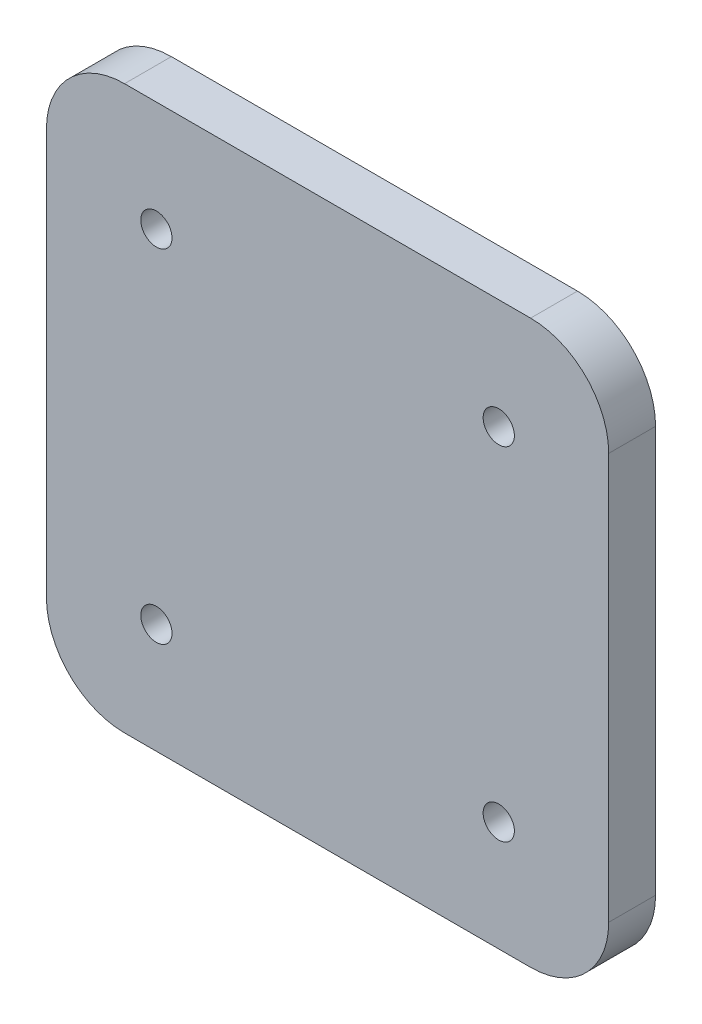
from build123d import *

# Parameters (mm, degrees)
SKETCH_1_R      = 1
EXTRUDE_1_DEPTH = 3


with BuildPart() as part:
    # Sketch 1 → Extrude 1 (new body)
    with BuildSketch(Plane.XY):
        with BuildLine():
            Line((-13, 18), (13, 18))
            ThreePointArc((13, 18), (16.535533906, 16.535533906), (18, 13))
            Line((18, 13), (18, -13))
            ThreePointArc((18, -13), (16.535533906, -16.535533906), (13, -18))
            Line((13, -18), (-13, -18))
            ThreePointArc((-13, -18), (-16.535533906, -16.535533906), (-18, -13))
            Line((-18, -13), (-18, 13))
            ThreePointArc((-18, 13), (-16.535533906, 16.535533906), (-13, 18))
        make_face()
        with Locations((10.960155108, 10.960155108)):
            Circle(SKETCH_1_R, mode=Mode.SUBTRACT)
        with Locations((10.960155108, -10.960155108)):
            Circle(SKETCH_1_R, mode=Mode.SUBTRACT)
        with Locations((-10.960155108, -10.960155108)):
            Circle(SKETCH_1_R, mode=Mode.SUBTRACT)
        with Locations((-10.960155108, 10.960155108)):
            Circle(SKETCH_1_R, mode=Mode.SUBTRACT)
    extrude(amount=EXTRUDE_1_DEPTH)


solid = part.part
